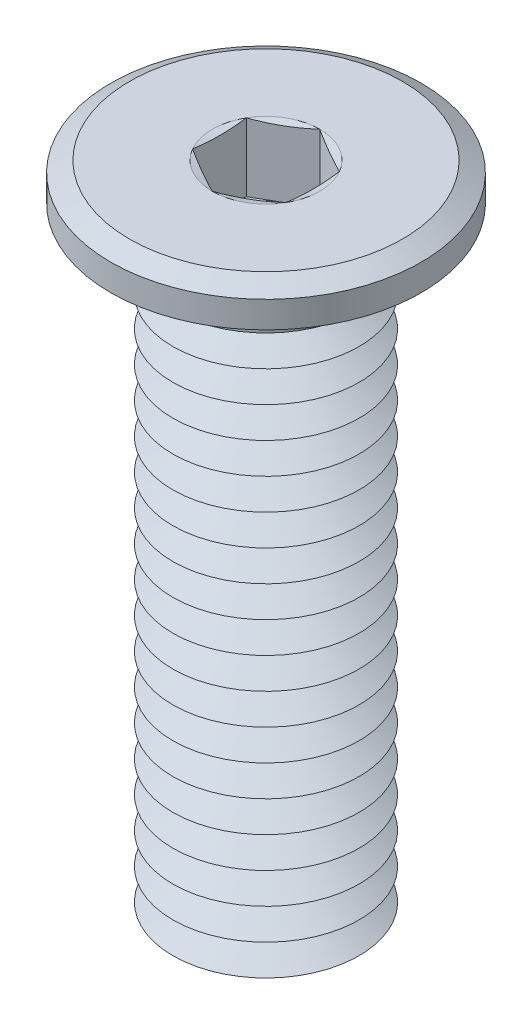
from build123d import *

# Parameters (mm, degrees)
SKETCH1_R           = 5
BOSS_EXTRUDE1_DEPTH = 1.2
SKETCH2_R           = 3
BOSS_EXTRUDE2_DEPTH = 20
LPATTERN1_COUNT     = 19
LPATTERN1_PITCH     = 1
FILLET1_R           = 0.25
CHAMFER2_SIZE       = 0.6
CHAMFER2_SIZE2      = 0.346410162
CUT_EXTRUDE1_DEPTH  = 2.2


with BuildPart() as part:
    # Sketch1 → Boss-Extrude1 (new body)
    with BuildSketch(Plane(origin=(0, 0, 0), x_dir=(1, 0, 0), z_dir=(0, 1, 0))):
        with Locations(Location((0, 0, 0), (0, 0, 270))):
            Circle(SKETCH1_R)
    extrude(amount=-BOSS_EXTRUDE1_DEPTH)

    # Sketch2 → Boss-Extrude2 (add)
    with BuildSketch(Plane.XZ.offset(1.2)):
        with Locations(Location((0, 0, 0), (0, 0, 270))):
            Circle(SKETCH2_R)
    extrude(amount=BOSS_EXTRUDE2_DEPTH)

    # Sketch5 → Cut-Revolve1 (revolve, cut)
    with BuildSketch(Plane(origin=(0, 0, 0), x_dir=(0, 0, -1), z_dir=(1, 0, 0))):
        Polygon((-3, -21.7), (-2.133974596, -21.2), (-3, -20.7), align=None)
    cut_revolve1 = revolve(axis=Axis((0, 0.990593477, 0), (0, -1, 0)), mode=Mode.SUBTRACT)

    # LPattern1: Cut-Revolve1 ×19
    with Locations(*[(0, i * LPATTERN1_PITCH, 0) for i in range(1, LPATTERN1_COUNT)]):
        add(cut_revolve1, mode=Mode.SUBTRACT)

    # Fillet1
    fillet1_edges = [part.edges().sort_by_distance(p)[0] for p in [
        (0, -1.2, 3),
    ]]
    fillet(fillet1_edges, radius=FILLET1_R)

    # Chamfer2
    chamfer2_edges = [part.edges().sort_by_distance(p)[0] for p in [
        (0, 0, -5),
    ]]
    chamfer2_side = [part.faces().sort_by_distance(p)[0] for p in [
        (0, 0, 0),
    ]]
    chamfer(chamfer2_edges, length=CHAMFER2_SIZE, length2=CHAMFER2_SIZE2, reference=chamfer2_side[0])

    # Sketch6 → Cut-Extrude1 (cut)
    with BuildSketch(Plane(origin=(0, 0, 0), x_dir=(1, 0, 0), z_dir=(0, 1, 0))):
        Polygon((0, 1.732050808), (-1.5, 0.866025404), (-1.5, -0.866025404), (0, -1.732050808), (1.5, -0.866025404), (1.5, 0.866025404), align=None)
    extrude(amount=-CUT_EXTRUDE1_DEPTH, mode=Mode.SUBTRACT)

    # Cut-Extrude2 cone 1 section (on through the dimple's axis) → Cut-Extrude2 (revolve, cut)
    with BuildSketch(Plane(origin=(0, -2.2, 0), x_dir=(0, 0, 1), z_dir=(1, 0, 0))):
        Polygon((0, 0), (1.5, 0), (0, 0.866025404), align=None)
    revolve(axis=Axis((0, -2.2, 0), (0, -1, 0)), mode=Mode.SUBTRACT)

    # Cut-Extrude3 cone 1 section (on through the dimple's axis) → Cut-Extrude3 (revolve, cut)
    with BuildSketch(Plane(origin=(0, 0, 0), x_dir=(0, 0, 1), z_dir=(1, 0, 0))):
        Polygon((0, 0), (1.732050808, 0), (0, 0.464101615), align=None)
    revolve(axis=Axis((0, 0, 0), (0, -1, 0)), mode=Mode.SUBTRACT)


solid = part.part
